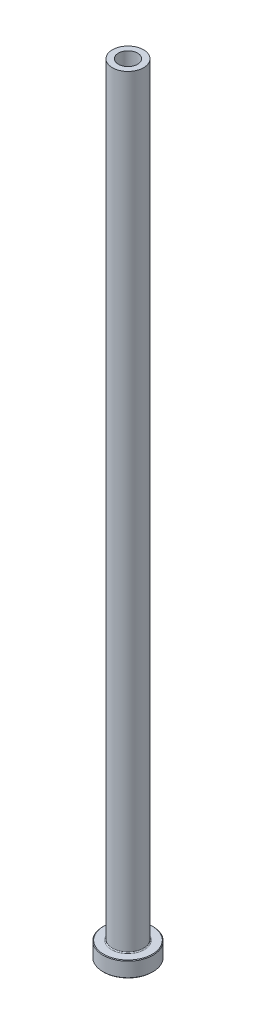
ISO-10303-21;
HEADER;
FILE_DESCRIPTION(('STEP AP214'),'2;1');
FILE_NAME('part.step','',(''),(''),'','','');
FILE_SCHEMA(('AUTOMOTIVE_DESIGN { 1 0 10303 214 1 1 1 1 }'));
ENDSEC;
DATA;
#1=APPLICATION_CONTEXT('core data for automotive mechanical design processes');
#2=APPLICATION_PROTOCOL_DEFINITION('international standard','automotive_design',2000,#1);
#3=PRODUCT_CONTEXT('',#1,'mechanical');
#4=PRODUCT('Part','Part','',(#3));
#5=PRODUCT_RELATED_PRODUCT_CATEGORY('part','',(#4));
#6=PRODUCT_DEFINITION_FORMATION('','',#4);
#7=PRODUCT_DEFINITION_CONTEXT('part definition',#1,'design');
#8=PRODUCT_DEFINITION('design','',#6,#7);
#9=PRODUCT_DEFINITION_SHAPE('','',#8);
#10=(LENGTH_UNIT() NAMED_UNIT(*) SI_UNIT(.MILLI.,.METRE.));
#11=(NAMED_UNIT(*) PLANE_ANGLE_UNIT() SI_UNIT($,.RADIAN.));
#12=(NAMED_UNIT(*) SI_UNIT($,.STERADIAN.) SOLID_ANGLE_UNIT());
#13=UNCERTAINTY_MEASURE_WITH_UNIT(LENGTH_MEASURE(1.E-05),#10,'distance_accuracy_value','');
#14=(GEOMETRIC_REPRESENTATION_CONTEXT(3) GLOBAL_UNCERTAINTY_ASSIGNED_CONTEXT((#13)) GLOBAL_UNIT_ASSIGNED_CONTEXT((#10,
#11,#12)) REPRESENTATION_CONTEXT('',''));
#15=CARTESIAN_POINT('',(0.,0.,0.));
#16=DIRECTION('',(0.,0.,1.));
#17=DIRECTION('',(1.,0.,0.));
#18=AXIS2_PLACEMENT_3D('',#15,#16,#17);
#19=CARTESIAN_POINT('',(0.,92.1876809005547,0.));
#20=DIRECTION('',(0.,1.,0.));
#21=DIRECTION('',(0.,0.,1.));
#22=AXIS2_PLACEMENT_3D('',#19,#20,#21);
#23=CYLINDRICAL_SURFACE('',#22,3.10000000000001);
#24=CARTESIAN_POINT('',(0.,250.,0.));
#25=DIRECTION('',(0.,1.,0.));
#26=DIRECTION('',(0.,0.,1.));
#27=AXIS2_PLACEMENT_3D('',#24,#25,#26);
#28=CIRCLE('',#27,3.10000000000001);
#29=CARTESIAN_POINT('',(0.,250.,3.10000000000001));
#30=VERTEX_POINT('',#29);
#31=EDGE_CURVE('E62',#30,#30,#28,.T.);
#32=ORIENTED_EDGE('',*,*,#31,.T.);
#33=EDGE_LOOP('',(#32));
#34=FACE_BOUND('',#33,.T.);
#35=CARTESIAN_POINT('',(0.,205.,0.));
#36=DIRECTION('',(0.,1.,0.));
#37=DIRECTION('',(0.,0.,1.));
#38=AXIS2_PLACEMENT_3D('',#35,#36,#37);
#39=CIRCLE('',#38,3.10000000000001);
#40=CARTESIAN_POINT('',(0.,205.,3.10000000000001));
#41=VERTEX_POINT('',#40);
#42=EDGE_CURVE('E71',#41,#41,#39,.T.);
#43=ORIENTED_EDGE('',*,*,#42,.F.);
#44=EDGE_LOOP('',(#43));
#45=FACE_BOUND('',#44,.T.);
#46=ADVANCED_FACE('F30',(#34,#45),#23,.F.);
#47=CARTESIAN_POINT('',(-3.10000000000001,250.,0.));
#48=DIRECTION('',(0.,1.,0.));
#49=DIRECTION('',(0.,0.,1.));
#50=AXIS2_PLACEMENT_3D('',#47,#48,#49);
#51=PLANE('',#50);
#52=CARTESIAN_POINT('',(0.,250.,0.));
#53=DIRECTION('',(0.,1.,0.));
#54=DIRECTION('',(0.,0.,1.));
#55=AXIS2_PLACEMENT_3D('',#52,#53,#54);
#56=CIRCLE('',#55,5.00000000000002);
#57=CARTESIAN_POINT('',(0.,250.,5.00000000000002));
#58=VERTEX_POINT('',#57);
#59=EDGE_CURVE('E65',#58,#58,#56,.T.);
#60=ORIENTED_EDGE('',*,*,#59,.T.);
#61=EDGE_LOOP('',(#60));
#62=FACE_BOUND('',#61,.T.);
#63=ORIENTED_EDGE('',*,*,#31,.F.);
#64=EDGE_LOOP('',(#63));
#65=FACE_BOUND('',#64,.T.);
#66=ADVANCED_FACE('F79',(#62,#65),#51,.T.);
#67=CARTESIAN_POINT('',(0.,92.1876809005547,0.));
#68=DIRECTION('',(0.,1.,0.));
#69=DIRECTION('',(0.,0.,1.));
#70=AXIS2_PLACEMENT_3D('',#67,#68,#69);
#71=CYLINDRICAL_SURFACE('',#70,5.);
#72=CARTESIAN_POINT('',(0.,5.3,0.));
#73=DIRECTION('',(0.,1.,0.));
#74=DIRECTION('',(0.,0.,1.));
#75=AXIS2_PLACEMENT_3D('',#72,#73,#74);
#76=CIRCLE('',#75,5.);
#77=CARTESIAN_POINT('',(0.,5.3,5.));
#78=VERTEX_POINT('',#77);
#79=EDGE_CURVE('E59',#78,#78,#76,.T.);
#80=ORIENTED_EDGE('',*,*,#79,.T.);
#81=EDGE_LOOP('',(#80));
#82=FACE_BOUND('',#81,.T.);
#83=ORIENTED_EDGE('',*,*,#59,.F.);
#84=EDGE_LOOP('',(#83));
#85=FACE_BOUND('',#84,.T.);
#86=ADVANCED_FACE('F85',(#82,#85),#71,.T.);
#87=CARTESIAN_POINT('',(-4.99999999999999,5.,0.));
#88=DIRECTION('',(0.,1.,0.));
#89=DIRECTION('',(0.,0.,1.));
#90=AXIS2_PLACEMENT_3D('',#87,#88,#89);
#91=PLANE('',#90);
#92=CARTESIAN_POINT('',(0.,5.,0.));
#93=DIRECTION('',(0.,1.,0.));
#94=DIRECTION('',(0.,0.,1.));
#95=AXIS2_PLACEMENT_3D('',#92,#93,#94);
#96=CIRCLE('',#95,7.79999999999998);
#97=CARTESIAN_POINT('',(0.,5.,7.79999999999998));
#98=VERTEX_POINT('',#97);
#99=EDGE_CURVE('E53',#98,#98,#96,.T.);
#100=ORIENTED_EDGE('',*,*,#99,.T.);
#101=EDGE_LOOP('',(#100));
#102=FACE_BOUND('',#101,.T.);
#103=CARTESIAN_POINT('',(0.,5.,0.));
#104=DIRECTION('',(0.,1.,0.));
#105=DIRECTION('',(0.,0.,1.));
#106=AXIS2_PLACEMENT_3D('',#103,#104,#105);
#107=CIRCLE('',#106,5.3);
#108=CARTESIAN_POINT('',(0.,5.,5.3));
#109=VERTEX_POINT('',#108);
#110=EDGE_CURVE('E56',#109,#109,#107,.F.);
#111=ORIENTED_EDGE('',*,*,#110,.T.);
#112=EDGE_LOOP('',(#111));
#113=FACE_BOUND('',#112,.T.);
#114=ADVANCED_FACE('F111',(#102,#113),#91,.T.);
#115=CARTESIAN_POINT('',(0.,92.1876809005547,0.));
#116=DIRECTION('',(0.,1.,0.));
#117=DIRECTION('',(0.,0.,1.));
#118=AXIS2_PLACEMENT_3D('',#115,#116,#117);
#119=CYLINDRICAL_SURFACE('',#118,7.99999999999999);
#120=CARTESIAN_POINT('',(0.,4.79999999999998,0.));
#121=DIRECTION('',(0.,1.,0.));
#122=DIRECTION('',(0.,0.,1.));
#123=AXIS2_PLACEMENT_3D('',#120,#121,#122);
#124=CIRCLE('',#123,7.99999999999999);
#125=CARTESIAN_POINT('',(0.,4.79999999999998,7.99999999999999));
#126=VERTEX_POINT('',#125);
#127=EDGE_CURVE('E45',#126,#126,#124,.F.);
#128=ORIENTED_EDGE('',*,*,#127,.T.);
#129=EDGE_LOOP('',(#128));
#130=FACE_BOUND('',#129,.T.);
#131=CARTESIAN_POINT('',(0.,0.200000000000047,0.));
#132=DIRECTION('',(0.,-1.,0.));
#133=DIRECTION('',(0.,0.,-1.));
#134=AXIS2_PLACEMENT_3D('',#131,#132,#133);
#135=CIRCLE('',#134,7.99999999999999);
#136=CARTESIAN_POINT('',(0.,0.200000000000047,-7.99999999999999));
#137=VERTEX_POINT('',#136);
#138=EDGE_CURVE('E50',#137,#137,#135,.F.);
#139=ORIENTED_EDGE('',*,*,#138,.T.);
#140=EDGE_LOOP('',(#139));
#141=FACE_BOUND('',#140,.T.);
#142=ADVANCED_FACE('F108',(#130,#141),#119,.T.);
#143=CARTESIAN_POINT('',(-7.99999999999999,0.,0.));
#144=DIRECTION('',(0.,-1.,0.));
#145=DIRECTION('',(0.,0.,-1.));
#146=AXIS2_PLACEMENT_3D('',#143,#144,#145);
#147=PLANE('',#146);
#148=CARTESIAN_POINT('',(0.,0.,0.));
#149=DIRECTION('',(0.,-1.,0.));
#150=DIRECTION('',(0.,0.,-1.));
#151=AXIS2_PLACEMENT_3D('',#148,#149,#150);
#152=CIRCLE('',#151,3.85000000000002);
#153=CARTESIAN_POINT('',(0.,0.,-3.85000000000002));
#154=VERTEX_POINT('',#153);
#155=EDGE_CURVE('E37',#154,#154,#152,.F.);
#156=ORIENTED_EDGE('',*,*,#155,.T.);
#157=EDGE_LOOP('',(#156));
#158=FACE_BOUND('',#157,.T.);
#159=CARTESIAN_POINT('',(0.,0.,0.));
#160=DIRECTION('',(0.,-1.,0.));
#161=DIRECTION('',(0.,0.,-1.));
#162=AXIS2_PLACEMENT_3D('',#159,#160,#161);
#163=CIRCLE('',#162,7.79999999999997);
#164=CARTESIAN_POINT('',(0.,0.,-7.79999999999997));
#165=VERTEX_POINT('',#164);
#166=EDGE_CURVE('E41',#165,#165,#163,.T.);
#167=ORIENTED_EDGE('',*,*,#166,.T.);
#168=EDGE_LOOP('',(#167));
#169=FACE_BOUND('',#168,.T.);
#170=ADVANCED_FACE('F110',(#158,#169),#147,.T.);
#171=CARTESIAN_POINT('',(0.,92.1876809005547,0.));
#172=DIRECTION('',(0.,1.,0.));
#173=DIRECTION('',(0.,0.,1.));
#174=AXIS2_PLACEMENT_3D('',#171,#172,#173);
#175=CYLINDRICAL_SURFACE('',#174,3.35);
#176=CARTESIAN_POINT('',(0.,0.5,0.));
#177=DIRECTION('',(0.,-1.,0.));
#178=DIRECTION('',(0.,0.,-1.));
#179=AXIS2_PLACEMENT_3D('',#176,#177,#178);
#180=CIRCLE('',#179,3.35);
#181=CARTESIAN_POINT('',(0.,0.5,-3.35));
#182=VERTEX_POINT('',#181);
#183=EDGE_CURVE('E10',#182,#182,#180,.T.);
#184=ORIENTED_EDGE('',*,*,#183,.T.);
#185=EDGE_LOOP('',(#184));
#186=FACE_BOUND('',#185,.T.);
#187=CARTESIAN_POINT('',(0.,193.,0.));
#188=DIRECTION('',(0.,1.,0.));
#189=DIRECTION('',(0.,0.,1.));
#190=AXIS2_PLACEMENT_3D('',#187,#188,#189);
#191=CIRCLE('',#190,3.35000000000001);
#192=CARTESIAN_POINT('',(0.,193.,3.35000000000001));
#193=VERTEX_POINT('',#192);
#194=EDGE_CURVE('E68',#193,#193,#191,.T.);
#195=ORIENTED_EDGE('',*,*,#194,.T.);
#196=EDGE_LOOP('',(#195));
#197=FACE_BOUND('',#196,.T.);
#198=ADVANCED_FACE('F118',(#186,#197),#175,.F.);
#199=CARTESIAN_POINT('',(0.,193.,0.));
#200=DIRECTION('',(0.,-1.,0.));
#201=DIRECTION('',(0.,0.,-1.));
#202=AXIS2_PLACEMENT_3D('',#199,#200,#201);
#203=CONICAL_SURFACE('',#202,3.35000000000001,0.0208303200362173);
#204=ORIENTED_EDGE('',*,*,#42,.T.);
#205=EDGE_LOOP('',(#204));
#206=FACE_BOUND('',#205,.T.);
#207=ORIENTED_EDGE('',*,*,#194,.F.);
#208=EDGE_LOOP('',(#207));
#209=FACE_BOUND('',#208,.T.);
#210=ADVANCED_FACE('F75',(#206,#209),#203,.F.);
#211=CARTESIAN_POINT('',(0.,5.3,0.));
#212=DIRECTION('',(0.,1.,0.));
#213=DIRECTION('',(0.,0.,1.));
#214=AXIS2_PLACEMENT_3D('',#211,#212,#213);
#215=TOROIDAL_SURFACE('',#214,5.3,0.3);
#216=ORIENTED_EDGE('',*,*,#110,.F.);
#217=EDGE_LOOP('',(#216));
#218=FACE_BOUND('',#217,.T.);
#219=ORIENTED_EDGE('',*,*,#79,.F.);
#220=EDGE_LOOP('',(#219));
#221=FACE_BOUND('',#220,.T.);
#222=ADVANCED_FACE('F90',(#218,#221),#215,.F.);
#223=CARTESIAN_POINT('',(0.,5.,0.));
#224=DIRECTION('',(0.,-1.,0.));
#225=DIRECTION('',(0.,0.,-1.));
#226=AXIS2_PLACEMENT_3D('',#223,#224,#225);
#227=CONICAL_SURFACE('',#226,7.79999999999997,0.78539816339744);
#228=ORIENTED_EDGE('',*,*,#127,.F.);
#229=EDGE_LOOP('',(#228));
#230=FACE_BOUND('',#229,.T.);
#231=ORIENTED_EDGE('',*,*,#99,.F.);
#232=EDGE_LOOP('',(#231));
#233=FACE_BOUND('',#232,.T.);
#234=ADVANCED_FACE('F93',(#230,#233),#227,.T.);
#235=CARTESIAN_POINT('',(0.,0.200000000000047,0.));
#236=DIRECTION('',(0.,1.,0.));
#237=DIRECTION('',(0.,0.,1.));
#238=AXIS2_PLACEMENT_3D('',#235,#236,#237);
#239=CONICAL_SURFACE('',#238,7.99999999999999,0.78539816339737);
#240=ORIENTED_EDGE('',*,*,#166,.F.);
#241=EDGE_LOOP('',(#240));
#242=FACE_BOUND('',#241,.T.);
#243=ORIENTED_EDGE('',*,*,#138,.F.);
#244=EDGE_LOOP('',(#243));
#245=FACE_BOUND('',#244,.T.);
#246=ADVANCED_FACE('F96',(#242,#245),#239,.T.);
#247=CARTESIAN_POINT('',(0.,0.,0.));
#248=DIRECTION('',(0.,-1.,0.));
#249=DIRECTION('',(0.,0.,-1.));
#250=AXIS2_PLACEMENT_3D('',#247,#248,#249);
#251=CONICAL_SURFACE('',#250,3.85000000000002,0.785398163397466);
#252=ORIENTED_EDGE('',*,*,#183,.F.);
#253=EDGE_LOOP('',(#252));
#254=FACE_BOUND('',#253,.T.);
#255=ORIENTED_EDGE('',*,*,#155,.F.);
#256=EDGE_LOOP('',(#255));
#257=FACE_BOUND('',#256,.T.);
#258=ADVANCED_FACE('F32',(#254,#257),#251,.F.);
#259=CLOSED_SHELL('',(#46,#66,#86,#114,#142,#170,#198,#210,#222,#234,#246,#258));
#260=MANIFOLD_SOLID_BREP('B2',#259);
#261=ADVANCED_BREP_SHAPE_REPRESENTATION('',(#18,#260),#14);
#262=SHAPE_DEFINITION_REPRESENTATION(#9,#261);
ENDSEC;
END-ISO-10303-21;
